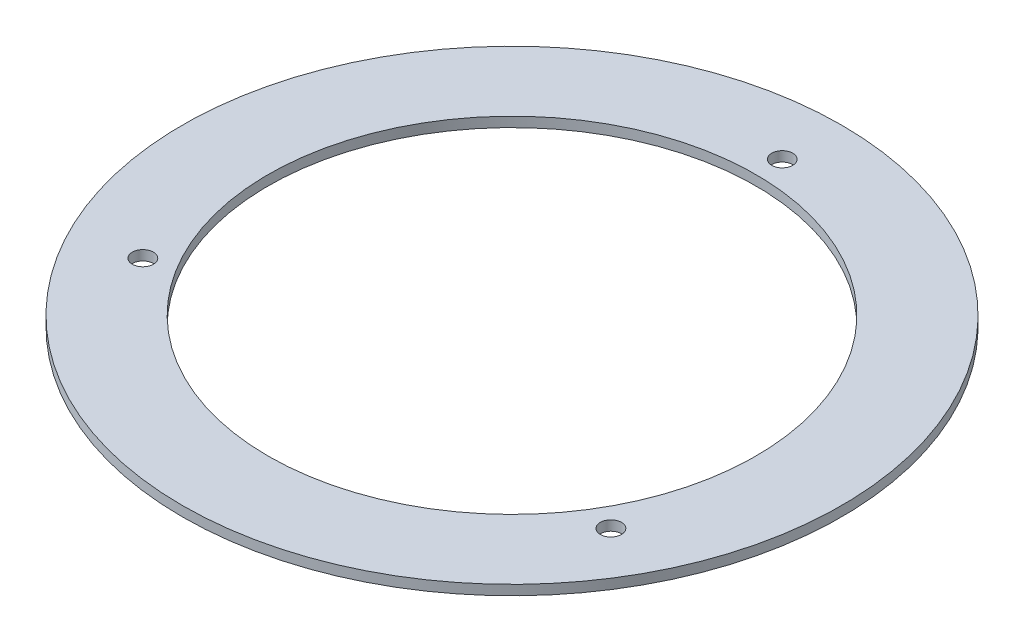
ISO-10303-21;
HEADER;
FILE_DESCRIPTION(('STEP AP214'),'2;1');
FILE_NAME('part.step','',(''),(''),'','','');
FILE_SCHEMA(('AUTOMOTIVE_DESIGN { 1 0 10303 214 1 1 1 1 }'));
ENDSEC;
DATA;
#1=APPLICATION_CONTEXT('core data for automotive mechanical design processes');
#2=APPLICATION_PROTOCOL_DEFINITION('international standard','automotive_design',2000,#1);
#3=PRODUCT_CONTEXT('',#1,'mechanical');
#4=PRODUCT('Part','Part','',(#3));
#5=PRODUCT_RELATED_PRODUCT_CATEGORY('part','',(#4));
#6=PRODUCT_DEFINITION_FORMATION('','',#4);
#7=PRODUCT_DEFINITION_CONTEXT('part definition',#1,'design');
#8=PRODUCT_DEFINITION('design','',#6,#7);
#9=PRODUCT_DEFINITION_SHAPE('','',#8);
#10=(LENGTH_UNIT() NAMED_UNIT(*) SI_UNIT(.MILLI.,.METRE.));
#11=(NAMED_UNIT(*) PLANE_ANGLE_UNIT() SI_UNIT($,.RADIAN.));
#12=(NAMED_UNIT(*) SI_UNIT($,.STERADIAN.) SOLID_ANGLE_UNIT());
#13=UNCERTAINTY_MEASURE_WITH_UNIT(LENGTH_MEASURE(1.E-05),#10,'distance_accuracy_value','');
#14=(GEOMETRIC_REPRESENTATION_CONTEXT(3) GLOBAL_UNCERTAINTY_ASSIGNED_CONTEXT((#13)) GLOBAL_UNIT_ASSIGNED_CONTEXT((#10,
#11,#12)) REPRESENTATION_CONTEXT('',''));
#15=CARTESIAN_POINT('',(0.,0.,0.));
#16=DIRECTION('',(0.,0.,1.));
#17=DIRECTION('',(1.,0.,0.));
#18=AXIS2_PLACEMENT_3D('',#15,#16,#17);
#19=CARTESIAN_POINT('',(0.,-1.5,0.));
#20=DIRECTION('',(0.,1.,0.));
#21=DIRECTION('',(0.,0.,1.));
#22=AXIS2_PLACEMENT_3D('',#19,#20,#21);
#23=CYLINDRICAL_SURFACE('',#22,50.);
#24=CARTESIAN_POINT('',(0.,-1.5,0.));
#25=DIRECTION('',(0.,1.,0.));
#26=DIRECTION('',(0.,0.,1.));
#27=AXIS2_PLACEMENT_3D('',#24,#25,#26);
#28=CIRCLE('',#27,50.);
#29=CARTESIAN_POINT('',(0.,-1.5,50.));
#30=VERTEX_POINT('',#29);
#31=EDGE_CURVE('E10',#30,#30,#28,.T.);
#32=ORIENTED_EDGE('',*,*,#31,.T.);
#33=EDGE_LOOP('',(#32));
#34=FACE_BOUND('',#33,.T.);
#35=CARTESIAN_POINT('',(0.,0.,0.));
#36=DIRECTION('',(0.,1.,0.));
#37=DIRECTION('',(0.,0.,1.));
#38=AXIS2_PLACEMENT_3D('',#35,#36,#37);
#39=CIRCLE('',#38,50.);
#40=CARTESIAN_POINT('',(0.,0.,50.));
#41=VERTEX_POINT('',#40);
#42=EDGE_CURVE('E46',#41,#41,#39,.T.);
#43=ORIENTED_EDGE('',*,*,#42,.F.);
#44=EDGE_LOOP('',(#43));
#45=FACE_BOUND('',#44,.T.);
#46=ADVANCED_FACE('F43',(#34,#45),#23,.T.);
#47=CARTESIAN_POINT('',(0.,-1.5,0.));
#48=DIRECTION('',(0.,1.,0.));
#49=DIRECTION('',(0.,0.,1.));
#50=AXIS2_PLACEMENT_3D('',#47,#48,#49);
#51=PLANE('',#50);
#52=CARTESIAN_POINT('',(0.,-1.5,-41.));
#53=DIRECTION('',(0.,1.,0.));
#54=DIRECTION('',(0.,0.,1.));
#55=AXIS2_PLACEMENT_3D('',#52,#53,#54);
#56=CIRCLE('',#55,1.6);
#57=CARTESIAN_POINT('',(0.,-1.5,-39.4));
#58=VERTEX_POINT('',#57);
#59=EDGE_CURVE('E58',#58,#58,#56,.T.);
#60=ORIENTED_EDGE('',*,*,#59,.T.);
#61=EDGE_LOOP('',(#60));
#62=FACE_BOUND('',#61,.T.);
#63=CARTESIAN_POINT('',(35.5070415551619,-1.5,20.5000000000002));
#64=DIRECTION('',(0.,1.,0.));
#65=DIRECTION('',(0.,0.,1.));
#66=AXIS2_PLACEMENT_3D('',#63,#64,#65);
#67=CIRCLE('',#66,1.6);
#68=CARTESIAN_POINT('',(35.5070415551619,-1.5,22.1000000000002));
#69=VERTEX_POINT('',#68);
#70=EDGE_CURVE('E67',#69,#69,#67,.T.);
#71=ORIENTED_EDGE('',*,*,#70,.T.);
#72=EDGE_LOOP('',(#71));
#73=FACE_BOUND('',#72,.T.);
#74=CARTESIAN_POINT('',(-35.5070415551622,-1.5,20.4999999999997));
#75=DIRECTION('',(0.,1.,0.));
#76=DIRECTION('',(0.,0.,1.));
#77=AXIS2_PLACEMENT_3D('',#74,#75,#76);
#78=CIRCLE('',#77,1.6);
#79=CARTESIAN_POINT('',(-35.5070415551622,-1.5,22.0999999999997));
#80=VERTEX_POINT('',#79);
#81=EDGE_CURVE('E61',#80,#80,#78,.T.);
#82=ORIENTED_EDGE('',*,*,#81,.T.);
#83=EDGE_LOOP('',(#82));
#84=FACE_BOUND('',#83,.T.);
#85=CARTESIAN_POINT('',(0.,-1.5,0.));
#86=DIRECTION('',(0.,1.,0.));
#87=DIRECTION('',(0.,0.,1.));
#88=AXIS2_PLACEMENT_3D('',#85,#86,#87);
#89=CIRCLE('',#88,37.);
#90=CARTESIAN_POINT('',(0.,-1.5,37.));
#91=VERTEX_POINT('',#90);
#92=EDGE_CURVE('E53',#91,#91,#89,.T.);
#93=ORIENTED_EDGE('',*,*,#92,.T.);
#94=EDGE_LOOP('',(#93));
#95=FACE_BOUND('',#94,.T.);
#96=ORIENTED_EDGE('',*,*,#31,.F.);
#97=EDGE_LOOP('',(#96));
#98=FACE_BOUND('',#97,.T.);
#99=ADVANCED_FACE('F79',(#62,#73,#84,#95,#98),#51,.F.);
#100=CARTESIAN_POINT('',(0.,0.,0.));
#101=DIRECTION('',(0.,1.,0.));
#102=DIRECTION('',(0.,0.,1.));
#103=AXIS2_PLACEMENT_3D('',#100,#101,#102);
#104=PLANE('',#103);
#105=CARTESIAN_POINT('',(0.,0.,-41.));
#106=DIRECTION('',(0.,1.,0.));
#107=DIRECTION('',(0.,0.,1.));
#108=AXIS2_PLACEMENT_3D('',#105,#106,#107);
#109=CIRCLE('',#108,1.6);
#110=CARTESIAN_POINT('',(0.,0.,-39.4));
#111=VERTEX_POINT('',#110);
#112=EDGE_CURVE('E73',#111,#111,#109,.T.);
#113=ORIENTED_EDGE('',*,*,#112,.F.);
#114=EDGE_LOOP('',(#113));
#115=FACE_BOUND('',#114,.T.);
#116=CARTESIAN_POINT('',(35.5070415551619,0.,20.5000000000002));
#117=DIRECTION('',(0.,1.,0.));
#118=DIRECTION('',(0.,0.,1.));
#119=AXIS2_PLACEMENT_3D('',#116,#117,#118);
#120=CIRCLE('',#119,1.6);
#121=CARTESIAN_POINT('',(35.5070415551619,0.,22.1000000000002));
#122=VERTEX_POINT('',#121);
#123=EDGE_CURVE('E70',#122,#122,#120,.T.);
#124=ORIENTED_EDGE('',*,*,#123,.F.);
#125=EDGE_LOOP('',(#124));
#126=FACE_BOUND('',#125,.T.);
#127=CARTESIAN_POINT('',(-35.5070415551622,0.,20.4999999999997));
#128=DIRECTION('',(0.,1.,0.));
#129=DIRECTION('',(0.,0.,1.));
#130=AXIS2_PLACEMENT_3D('',#127,#128,#129);
#131=CIRCLE('',#130,1.6);
#132=CARTESIAN_POINT('',(-35.5070415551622,0.,22.0999999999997));
#133=VERTEX_POINT('',#132);
#134=EDGE_CURVE('E64',#133,#133,#131,.T.);
#135=ORIENTED_EDGE('',*,*,#134,.F.);
#136=EDGE_LOOP('',(#135));
#137=FACE_BOUND('',#136,.T.);
#138=CARTESIAN_POINT('',(0.,0.,0.));
#139=DIRECTION('',(0.,1.,0.));
#140=DIRECTION('',(0.,0.,1.));
#141=AXIS2_PLACEMENT_3D('',#138,#139,#140);
#142=CIRCLE('',#141,37.);
#143=CARTESIAN_POINT('',(0.,0.,37.));
#144=VERTEX_POINT('',#143);
#145=EDGE_CURVE('E55',#144,#144,#142,.T.);
#146=ORIENTED_EDGE('',*,*,#145,.F.);
#147=EDGE_LOOP('',(#146));
#148=FACE_BOUND('',#147,.T.);
#149=ORIENTED_EDGE('',*,*,#42,.T.);
#150=EDGE_LOOP('',(#149));
#151=FACE_BOUND('',#150,.T.);
#152=ADVANCED_FACE('F89',(#115,#126,#137,#148,#151),#104,.T.);
#153=CARTESIAN_POINT('',(0.,-1.5,0.));
#154=DIRECTION('',(0.,1.,0.));
#155=DIRECTION('',(0.,0.,1.));
#156=AXIS2_PLACEMENT_3D('',#153,#154,#155);
#157=CYLINDRICAL_SURFACE('',#156,37.);
#158=ORIENTED_EDGE('',*,*,#92,.F.);
#159=EDGE_LOOP('',(#158));
#160=FACE_BOUND('',#159,.T.);
#161=ORIENTED_EDGE('',*,*,#145,.T.);
#162=EDGE_LOOP('',(#161));
#163=FACE_BOUND('',#162,.T.);
#164=ADVANCED_FACE('F92',(#160,#163),#157,.F.);
#165=CARTESIAN_POINT('',(-35.5070415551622,-1.5,20.4999999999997));
#166=DIRECTION('',(0.,1.,0.));
#167=DIRECTION('',(0.,0.,1.));
#168=AXIS2_PLACEMENT_3D('',#165,#166,#167);
#169=CYLINDRICAL_SURFACE('',#168,1.6);
#170=ORIENTED_EDGE('',*,*,#81,.F.);
#171=EDGE_LOOP('',(#170));
#172=FACE_BOUND('',#171,.T.);
#173=ORIENTED_EDGE('',*,*,#134,.T.);
#174=EDGE_LOOP('',(#173));
#175=FACE_BOUND('',#174,.T.);
#176=ADVANCED_FACE('F111',(#172,#175),#169,.F.);
#177=CARTESIAN_POINT('',(35.5070415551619,-1.5,20.5000000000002));
#178=DIRECTION('',(0.,1.,0.));
#179=DIRECTION('',(0.,0.,1.));
#180=AXIS2_PLACEMENT_3D('',#177,#178,#179);
#181=CYLINDRICAL_SURFACE('',#180,1.6);
#182=ORIENTED_EDGE('',*,*,#70,.F.);
#183=EDGE_LOOP('',(#182));
#184=FACE_BOUND('',#183,.T.);
#185=ORIENTED_EDGE('',*,*,#123,.T.);
#186=EDGE_LOOP('',(#185));
#187=FACE_BOUND('',#186,.T.);
#188=ADVANCED_FACE('F85',(#184,#187),#181,.F.);
#189=CARTESIAN_POINT('',(0.,-1.5,-41.));
#190=DIRECTION('',(0.,1.,0.));
#191=DIRECTION('',(0.,0.,1.));
#192=AXIS2_PLACEMENT_3D('',#189,#190,#191);
#193=CYLINDRICAL_SURFACE('',#192,1.6);
#194=ORIENTED_EDGE('',*,*,#59,.F.);
#195=EDGE_LOOP('',(#194));
#196=FACE_BOUND('',#195,.T.);
#197=ORIENTED_EDGE('',*,*,#112,.T.);
#198=EDGE_LOOP('',(#197));
#199=FACE_BOUND('',#198,.T.);
#200=ADVANCED_FACE('F82',(#196,#199),#193,.F.);
#201=CLOSED_SHELL('',(#46,#99,#152,#164,#176,#188,#200));
#202=MANIFOLD_SOLID_BREP('B2',#201);
#203=ADVANCED_BREP_SHAPE_REPRESENTATION('',(#18,#202),#14);
#204=SHAPE_DEFINITION_REPRESENTATION(#9,#203);
ENDSEC;
END-ISO-10303-21;
